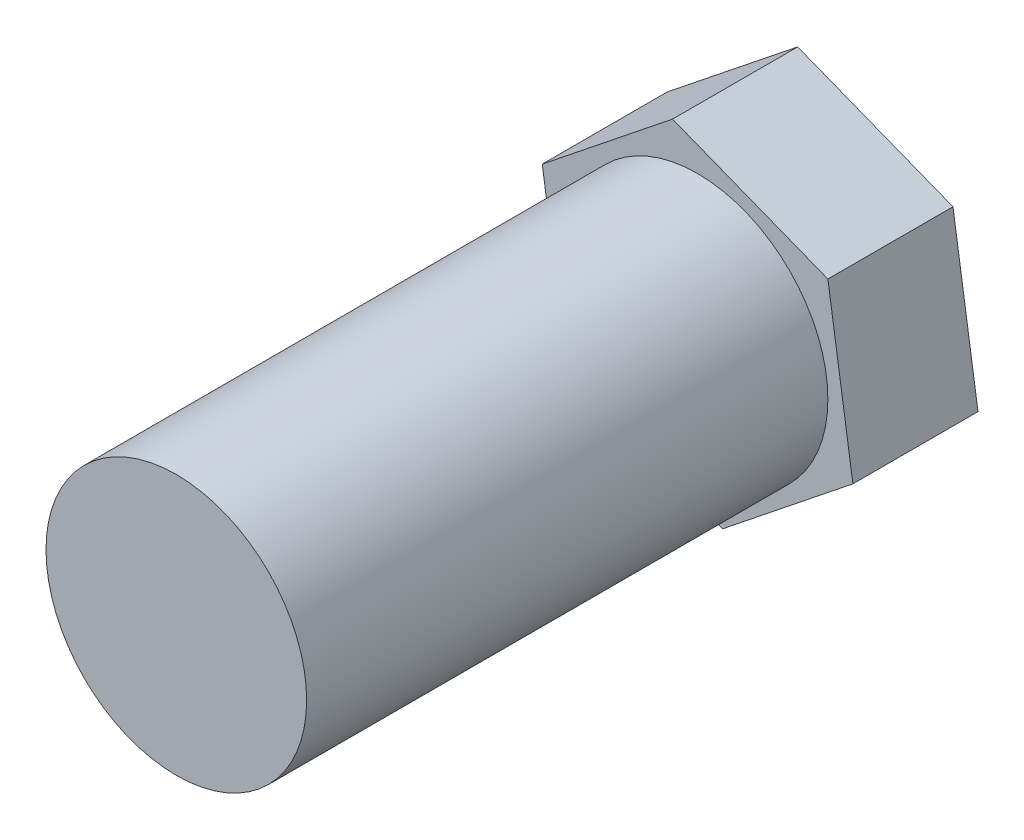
from build123d import *

# Parameters (mm, degrees)
CROQUIS1_R              = 6.25
SALIENTE_EXTRUIR1_DEPTH = 25
SALIENTE_EXTRUIR2_DEPTH = 6


with BuildPart() as part:
    # Croquis1 → Saliente-Extruir1 (new body)
    with BuildSketch(Plane.XY):
        Circle(CROQUIS1_R)
    extrude(amount=SALIENTE_EXTRUIR1_DEPTH)

    # Croquis2 → Saliente-Extruir2 (add)
    with BuildSketch(Plane(origin=(0, 0, 0), x_dir=(-1, 0, 0), z_dir=(0, 0, -1))):
        Polygon((1.200133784, 7.909467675), (-6.249733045, 4.994080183), (-7.449866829, -2.915387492), (-1.200133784, -7.909467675), (6.249733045, -4.994080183), (7.449866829, 2.915387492), align=None)
    extrude(amount=SALIENTE_EXTRUIR2_DEPTH)


solid = part.part
